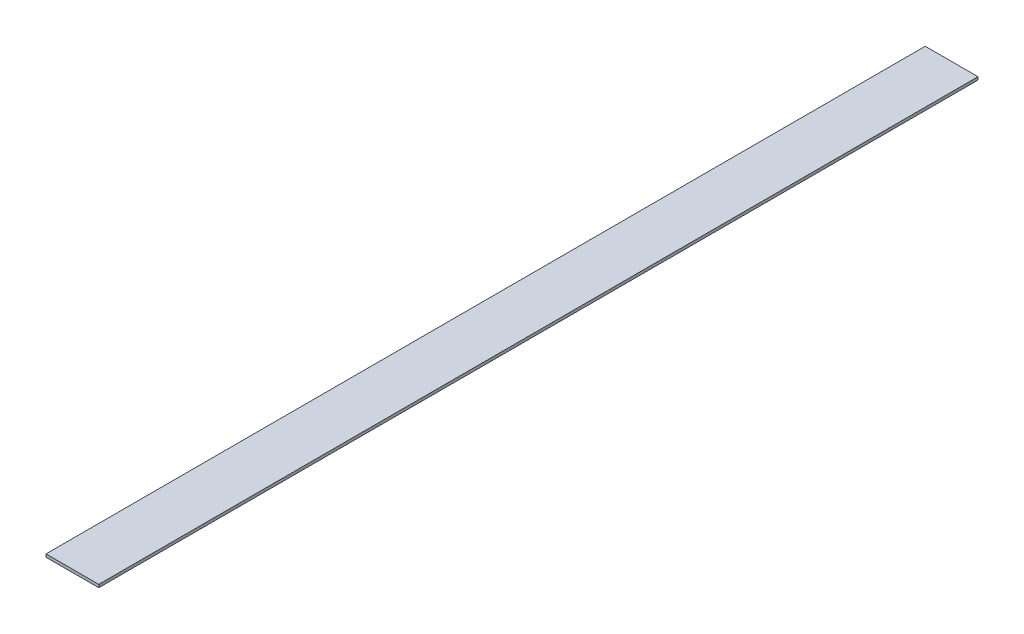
ISO-10303-21;
HEADER;
FILE_DESCRIPTION(('STEP AP214'),'2;1');
FILE_NAME('part.step','',(''),(''),'','','');
FILE_SCHEMA(('AUTOMOTIVE_DESIGN { 1 0 10303 214 1 1 1 1 }'));
ENDSEC;
DATA;
#1=APPLICATION_CONTEXT('core data for automotive mechanical design processes');
#2=APPLICATION_PROTOCOL_DEFINITION('international standard','automotive_design',2000,#1);
#3=PRODUCT_CONTEXT('',#1,'mechanical');
#4=PRODUCT('Part','Part','',(#3));
#5=PRODUCT_RELATED_PRODUCT_CATEGORY('part','',(#4));
#6=PRODUCT_DEFINITION_FORMATION('','',#4);
#7=PRODUCT_DEFINITION_CONTEXT('part definition',#1,'design');
#8=PRODUCT_DEFINITION('design','',#6,#7);
#9=PRODUCT_DEFINITION_SHAPE('','',#8);
#10=(LENGTH_UNIT() NAMED_UNIT(*) SI_UNIT(.MILLI.,.METRE.));
#11=(NAMED_UNIT(*) PLANE_ANGLE_UNIT() SI_UNIT($,.RADIAN.));
#12=(NAMED_UNIT(*) SI_UNIT($,.STERADIAN.) SOLID_ANGLE_UNIT());
#13=UNCERTAINTY_MEASURE_WITH_UNIT(LENGTH_MEASURE(1.E-05),#10,'distance_accuracy_value','');
#14=(GEOMETRIC_REPRESENTATION_CONTEXT(3) GLOBAL_UNCERTAINTY_ASSIGNED_CONTEXT((#13)) GLOBAL_UNIT_ASSIGNED_CONTEXT((#10,
#11,#12)) REPRESENTATION_CONTEXT('',''));
#15=CARTESIAN_POINT('',(0.,0.,0.));
#16=DIRECTION('',(0.,0.,1.));
#17=DIRECTION('',(1.,0.,0.));
#18=AXIS2_PLACEMENT_3D('',#15,#16,#17);
#19=CARTESIAN_POINT('',(0.,0.,1500.));
#20=DIRECTION('',(1.,0.,0.));
#21=DIRECTION('',(0.,1.,0.));
#22=AXIS2_PLACEMENT_3D('',#19,#20,#21);
#23=PLANE('',#22);
#24=DIRECTION('',(0.,-1.,0.));
#25=VECTOR('',#24,1.);
#26=CARTESIAN_POINT('',(0.,0.,0.));
#27=LINE('',#26,#25);
#28=CARTESIAN_POINT('',(0.,0.,0.));
#29=VERTEX_POINT('',#28);
#30=CARTESIAN_POINT('',(0.,-5.,0.));
#31=VERTEX_POINT('',#30);
#32=EDGE_CURVE('E73',#29,#31,#27,.T.);
#33=ORIENTED_EDGE('',*,*,#32,.T.);
#34=DIRECTION('',(0.,0.,-1.));
#35=VECTOR('',#34,1.);
#36=CARTESIAN_POINT('',(0.,-5.,1500.));
#37=LINE('',#36,#35);
#38=CARTESIAN_POINT('',(0.,-5.,1500.));
#39=VERTEX_POINT('',#38);
#40=EDGE_CURVE('E11',#39,#31,#37,.T.);
#41=ORIENTED_EDGE('',*,*,#40,.F.);
#42=DIRECTION('',(0.,-1.,0.));
#43=VECTOR('',#42,1.);
#44=CARTESIAN_POINT('',(0.,0.,1500.));
#45=LINE('',#44,#43);
#46=CARTESIAN_POINT('',(0.,0.,1500.));
#47=VERTEX_POINT('',#46);
#48=EDGE_CURVE('E91',#47,#39,#45,.T.);
#49=ORIENTED_EDGE('',*,*,#48,.F.);
#50=DIRECTION('',(0.,0.,-1.));
#51=VECTOR('',#50,1.);
#52=CARTESIAN_POINT('',(0.,0.,1500.));
#53=LINE('',#52,#51);
#54=EDGE_CURVE('E85',#47,#29,#53,.T.);
#55=ORIENTED_EDGE('',*,*,#54,.T.);
#56=EDGE_LOOP('',(#33,#41,#49,#55));
#57=FACE_BOUND('',#56,.T.);
#58=ADVANCED_FACE('F29',(#57),#23,.F.);
#59=CARTESIAN_POINT('',(0.,-5.,1500.));
#60=DIRECTION('',(0.,1.,0.));
#61=DIRECTION('',(0.,0.,1.));
#62=AXIS2_PLACEMENT_3D('',#59,#60,#61);
#63=PLANE('',#62);
#64=DIRECTION('',(1.,0.,0.));
#65=VECTOR('',#64,1.);
#66=CARTESIAN_POINT('',(0.,-5.,0.));
#67=LINE('',#66,#65);
#68=CARTESIAN_POINT('',(90.,-5.,0.));
#69=VERTEX_POINT('',#68);
#70=EDGE_CURVE('E69',#31,#69,#67,.T.);
#71=ORIENTED_EDGE('',*,*,#70,.T.);
#72=DIRECTION('',(0.,0.,-1.));
#73=VECTOR('',#72,1.);
#74=CARTESIAN_POINT('',(90.,-5.,1500.));
#75=LINE('',#74,#73);
#76=CARTESIAN_POINT('',(90.,-5.,1500.));
#77=VERTEX_POINT('',#76);
#78=EDGE_CURVE('E36',#77,#69,#75,.T.);
#79=ORIENTED_EDGE('',*,*,#78,.F.);
#80=DIRECTION('',(1.,0.,0.));
#81=VECTOR('',#80,1.);
#82=CARTESIAN_POINT('',(0.,-5.,1500.));
#83=LINE('',#82,#81);
#84=EDGE_CURVE('E81',#39,#77,#83,.T.);
#85=ORIENTED_EDGE('',*,*,#84,.F.);
#86=ORIENTED_EDGE('',*,*,#40,.T.);
#87=EDGE_LOOP('',(#71,#79,#85,#86));
#88=FACE_BOUND('',#87,.T.);
#89=ADVANCED_FACE('F80',(#88),#63,.F.);
#90=CARTESIAN_POINT('',(90.,0.,1500.));
#91=DIRECTION('',(-1.,0.,0.));
#92=DIRECTION('',(0.,0.,1.));
#93=AXIS2_PLACEMENT_3D('',#90,#91,#92);
#94=PLANE('',#93);
#95=DIRECTION('',(0.,1.,0.));
#96=VECTOR('',#95,1.);
#97=CARTESIAN_POINT('',(90.,0.,0.));
#98=LINE('',#97,#96);
#99=CARTESIAN_POINT('',(90.,0.,0.));
#100=VERTEX_POINT('',#99);
#101=EDGE_CURVE('E74',#69,#100,#98,.T.);
#102=ORIENTED_EDGE('',*,*,#101,.T.);
#103=DIRECTION('',(0.,0.,-1.));
#104=VECTOR('',#103,1.);
#105=CARTESIAN_POINT('',(90.,0.,1500.));
#106=LINE('',#105,#104);
#107=CARTESIAN_POINT('',(90.,0.,1500.));
#108=VERTEX_POINT('',#107);
#109=EDGE_CURVE('E97',#108,#100,#106,.T.);
#110=ORIENTED_EDGE('',*,*,#109,.F.);
#111=DIRECTION('',(0.,1.,0.));
#112=VECTOR('',#111,1.);
#113=CARTESIAN_POINT('',(90.,0.,1500.));
#114=LINE('',#113,#112);
#115=EDGE_CURVE('E48',#77,#108,#114,.T.);
#116=ORIENTED_EDGE('',*,*,#115,.F.);
#117=ORIENTED_EDGE('',*,*,#78,.T.);
#118=EDGE_LOOP('',(#102,#110,#116,#117));
#119=FACE_BOUND('',#118,.T.);
#120=ADVANCED_FACE('F100',(#119),#94,.F.);
#121=CARTESIAN_POINT('',(0.,0.,1500.));
#122=DIRECTION('',(0.,-1.,0.));
#123=DIRECTION('',(0.,0.,-1.));
#124=AXIS2_PLACEMENT_3D('',#121,#122,#123);
#125=PLANE('',#124);
#126=DIRECTION('',(-1.,0.,0.));
#127=VECTOR('',#126,1.);
#128=CARTESIAN_POINT('',(0.,0.,0.));
#129=LINE('',#128,#127);
#130=EDGE_CURVE('E89',#100,#29,#129,.T.);
#131=ORIENTED_EDGE('',*,*,#130,.T.);
#132=ORIENTED_EDGE('',*,*,#54,.F.);
#133=DIRECTION('',(-1.,0.,0.));
#134=VECTOR('',#133,1.);
#135=CARTESIAN_POINT('',(0.,0.,1500.));
#136=LINE('',#135,#134);
#137=EDGE_CURVE('E43',#108,#47,#136,.T.);
#138=ORIENTED_EDGE('',*,*,#137,.F.);
#139=ORIENTED_EDGE('',*,*,#109,.T.);
#140=EDGE_LOOP('',(#131,#132,#138,#139));
#141=FACE_BOUND('',#140,.T.);
#142=ADVANCED_FACE('F102',(#141),#125,.F.);
#143=CARTESIAN_POINT('',(0.,-5.,1500.));
#144=DIRECTION('',(0.,0.,1.));
#145=DIRECTION('',(1.,0.,0.));
#146=AXIS2_PLACEMENT_3D('',#143,#144,#145);
#147=PLANE('',#146);
#148=ORIENTED_EDGE('',*,*,#48,.T.);
#149=ORIENTED_EDGE('',*,*,#84,.T.);
#150=ORIENTED_EDGE('',*,*,#115,.T.);
#151=ORIENTED_EDGE('',*,*,#137,.T.);
#152=EDGE_LOOP('',(#148,#149,#150,#151));
#153=FACE_BOUND('',#152,.T.);
#154=ADVANCED_FACE('F103',(#153),#147,.T.);
#155=CARTESIAN_POINT('',(0.,-5.,0.));
#156=DIRECTION('',(0.,0.,1.));
#157=DIRECTION('',(1.,0.,0.));
#158=AXIS2_PLACEMENT_3D('',#155,#156,#157);
#159=PLANE('',#158);
#160=ORIENTED_EDGE('',*,*,#32,.F.);
#161=ORIENTED_EDGE('',*,*,#130,.F.);
#162=ORIENTED_EDGE('',*,*,#101,.F.);
#163=ORIENTED_EDGE('',*,*,#70,.F.);
#164=EDGE_LOOP('',(#160,#161,#162,#163));
#165=FACE_BOUND('',#164,.T.);
#166=ADVANCED_FACE('F70',(#165),#159,.F.);
#167=CLOSED_SHELL('',(#58,#89,#120,#142,#154,#166));
#168=MANIFOLD_SOLID_BREP('B2',#167);
#169=ADVANCED_BREP_SHAPE_REPRESENTATION('',(#18,#168),#14);
#170=SHAPE_DEFINITION_REPRESENTATION(#9,#169);
ENDSEC;
END-ISO-10303-21;
